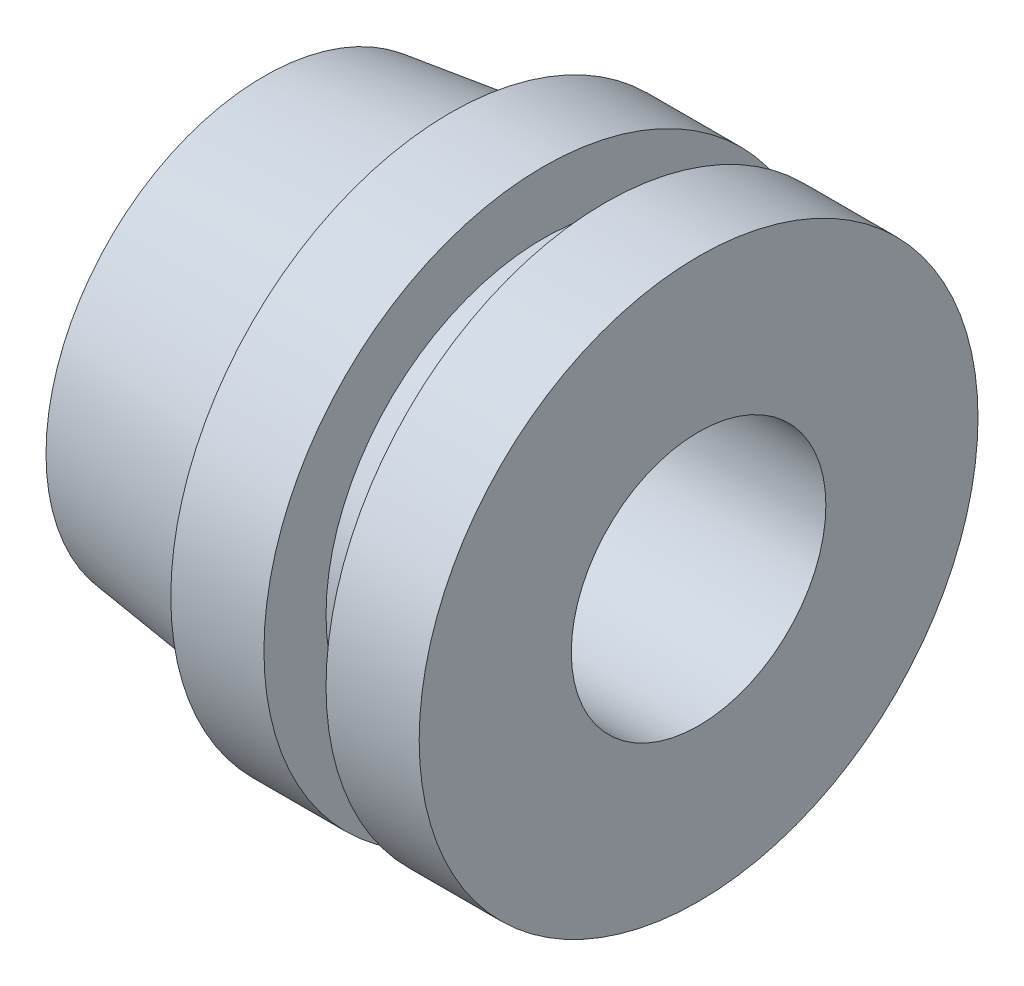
from build123d import *

# Parameters (mm, degrees)
M2_5X0_45_TAPPED_HOLE1_D = 2.05


with BuildPart() as part:
    # Sketch2 → Revolve1 (revolve)
    with BuildSketch(Plane.XY, mode=Mode.PRIVATE) as revolve1_sk:
        Polygon((0, -1), (-3.5, -1), (-3.5, -1.755), (-2, -1.95), (-2, -2.25), (-1.25, -2.25), (-1.25, -1.75), (-0.75, -1.75), (-0.75, -2.25), (0, -2.25), align=None)
    revolve(revolve1_sk.sketch.rotate(Axis((-109.061504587, 0, 0), (1, 0, 0)), 270), axis=Axis((-109.061504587, 0, 0), (1, 0, 0)))

    # M2.5x0.45 Tapped Hole1 (through all)
    with Locations(Plane(origin=(0, 0, 0), x_dir=(0, 0, -1), z_dir=(1, 0, 0))):
        with Locations((0, 0)):
            Hole(M2_5X0_45_TAPPED_HOLE1_D / 2)


solid = part.part
